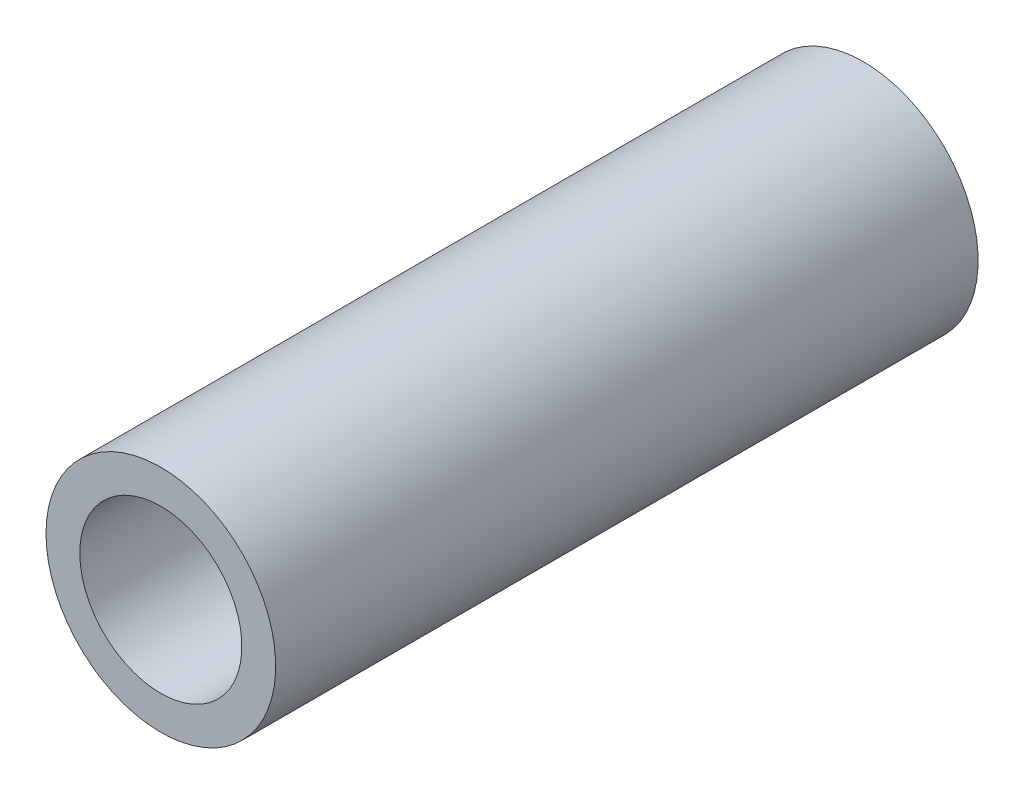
from build123d import *

# Parameters (mm, degrees)
ESQUISSE1_R      = 8.5
ESQUISSE1_R_2    = 6
EXTRUSION1_DEPTH = 52


with BuildPart() as part:
    # Esquisse1 → Extrusion1 (new body)
    with BuildSketch(Plane.XY):
        with Locations(Location((0, 0, 0), (0, 0, 180))):
            Circle(ESQUISSE1_R)
        with Locations(Location((0, 0, 0), (0, 0, 180))):
            Circle(ESQUISSE1_R_2, mode=Mode.SUBTRACT)
    extrude(amount=EXTRUSION1_DEPTH)


solid = part.part
